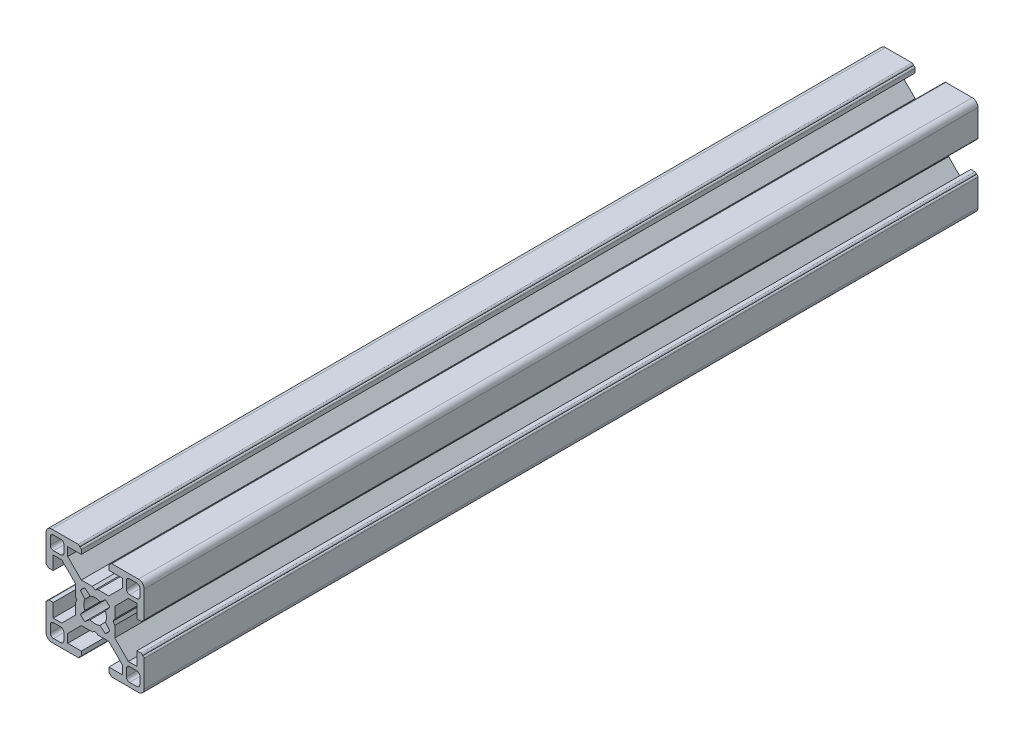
from build123d import *

# Parameters (mm, degrees)
EXTRUSION_3030_DEPTH  = 127
PATTERN_EXTRUDE_COUNT = 4


with BuildPart() as part:
    # Sketch1 → Extrusion_3030 (new, symmetric)
    with BuildSketch(Plane.XY):
        with BuildLine():
            Line((-8.325, 12.75), (-4.2, 12.75))
            Line((-4.2, 12.75), (-4.2, 14))
            ThreePointArc((-4.2, 14), (-4.331801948, 14.318198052), (-4.65, 14.45))
            Line((-4.65, 14.45), (-4.7, 14.45))
            Line((-4.7, 14.45), (-4.7, 14.5))
            ThreePointArc((-4.7, 14.5), (-4.831801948, 14.818198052), (-5.15, 14.95))
            Line((-5.15, 14.95), (-13.2, 14.95))
            ThreePointArc((-13.2, 14.95), (-14.437436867, 14.437436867), (-14.95, 13.2))
            Line((-14.95, 13.2), (-14.95, 5.15))
            ThreePointArc((-14.95, 5.15), (-14.818198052, 4.831801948), (-14.5, 4.7))
            Line((-14.5, 4.7), (-14.45, 4.7))
            Line((-14.45, 4.7), (-14.45, 4.65))
            ThreePointArc((-14.45, 4.65), (-14.318198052, 4.331801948), (-14, 4.2))
            Line((-14, 4.2), (-12.75, 4.2))
            Line((-12.75, 4.2), (-12.75, 8.325))
            Line((-12.75, 8.325), (-10.13519336, 8.325))
            Line((-10.13519336, 8.325), (-6, 4.18980664))
            Line((-6, 4.18980664), (-6, 0.875))
            Line((-6, 0.875), (-5.5, 0))
            Line((-5.5, 0), (-3.455011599, 0))
            ThreePointArc((-3.455011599, 0), (-3.369431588, 0.764222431), (-3.116931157, 1.49058556))
            Line((-3.116931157, 1.49058556), (-4.456792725, 3.162787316))
            ThreePointArc((-4.456792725, 3.162787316), (-3.864338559, 3.864338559), (-3.162787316, 4.456792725))
            Line((-3.162787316, 4.456792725), (-1.49058556, 3.116931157))
            ThreePointArc((-1.49058556, 3.116931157), (-0.764222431, 3.369431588), (0, 3.455011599))
            Line((0, 3.455011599), (0, 5.5))
            Line((0, 5.5), (-0.875, 6))
            Line((-0.875, 6), (-4.18980664, 6))
            Line((-4.18980664, 6), (-8.325, 10.13519336))
            Line((-8.325, 10.13519336), (-8.325, 12.75))
        make_face()
        with BuildLine():
            Line((-13.65, 10.5), (-13.65, 12.65))
            ThreePointArc((-13.65, 12.65), (-13.357106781, 13.357106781), (-12.65, 13.65))
            Line((-12.65, 13.65), (-10.5, 13.65))
            ThreePointArc((-10.5, 13.65), (-9.792893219, 13.357106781), (-9.5, 12.65))
            Line((-9.5, 12.65), (-9.5, 10.5))
            ThreePointArc((-9.5, 10.5), (-9.792893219, 9.792893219), (-10.5, 9.5))
            Line((-10.5, 9.5), (-12.65, 9.5))
            ThreePointArc((-12.65, 9.5), (-13.357106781, 9.792893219), (-13.65, 10.5))
        make_face(mode=Mode.SUBTRACT)
    extrusion_3030 = extrude(amount=EXTRUSION_3030_DEPTH, both=True)

    # pattern_extrude: Extrusion_3030 ×4 about axis
    pattern_extrude_axis = Axis((0, 0, 0), (0, 0, 1))
    for i in range(1, PATTERN_EXTRUDE_COUNT):
        add(extrusion_3030.rotate(pattern_extrude_axis, i * 360 / PATTERN_EXTRUDE_COUNT))


solid = part.part
